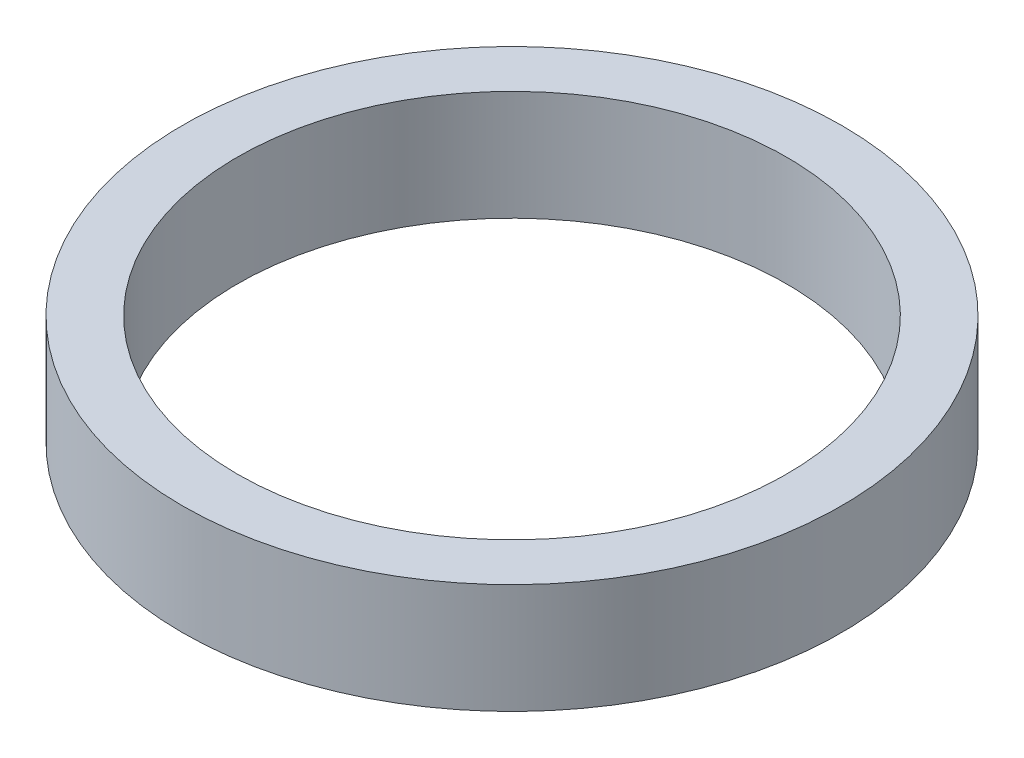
ISO-10303-21;
HEADER;
FILE_DESCRIPTION(('STEP AP214'),'2;1');
FILE_NAME('part.step','',(''),(''),'','','');
FILE_SCHEMA(('AUTOMOTIVE_DESIGN { 1 0 10303 214 1 1 1 1 }'));
ENDSEC;
DATA;
#1=APPLICATION_CONTEXT('core data for automotive mechanical design processes');
#2=APPLICATION_PROTOCOL_DEFINITION('international standard','automotive_design',2000,#1);
#3=PRODUCT_CONTEXT('',#1,'mechanical');
#4=PRODUCT('Part','Part','',(#3));
#5=PRODUCT_RELATED_PRODUCT_CATEGORY('part','',(#4));
#6=PRODUCT_DEFINITION_FORMATION('','',#4);
#7=PRODUCT_DEFINITION_CONTEXT('part definition',#1,'design');
#8=PRODUCT_DEFINITION('design','',#6,#7);
#9=PRODUCT_DEFINITION_SHAPE('','',#8);
#10=(LENGTH_UNIT() NAMED_UNIT(*) SI_UNIT(.MILLI.,.METRE.));
#11=(NAMED_UNIT(*) PLANE_ANGLE_UNIT() SI_UNIT($,.RADIAN.));
#12=(NAMED_UNIT(*) SI_UNIT($,.STERADIAN.) SOLID_ANGLE_UNIT());
#13=UNCERTAINTY_MEASURE_WITH_UNIT(LENGTH_MEASURE(1.E-05),#10,'distance_accuracy_value','');
#14=(GEOMETRIC_REPRESENTATION_CONTEXT(3) GLOBAL_UNCERTAINTY_ASSIGNED_CONTEXT((#13)) GLOBAL_UNIT_ASSIGNED_CONTEXT((#10,
#11,#12)) REPRESENTATION_CONTEXT('',''));
#15=CARTESIAN_POINT('',(0.,0.,0.));
#16=DIRECTION('',(0.,0.,1.));
#17=DIRECTION('',(1.,0.,0.));
#18=AXIS2_PLACEMENT_3D('',#15,#16,#17);
#19=CARTESIAN_POINT('',(0.,2.,0.));
#20=DIRECTION('',(0.,1.,0.));
#21=DIRECTION('',(0.,0.,1.));
#22=AXIS2_PLACEMENT_3D('',#19,#20,#21);
#23=PLANE('',#22);
#24=CARTESIAN_POINT('',(0.,2.,0.));
#25=DIRECTION('',(0.,1.,0.));
#26=DIRECTION('',(0.,0.,1.));
#27=AXIS2_PLACEMENT_3D('',#24,#25,#26);
#28=CIRCLE('',#27,6.);
#29=CARTESIAN_POINT('',(0.,2.,6.));
#30=VERTEX_POINT('',#29);
#31=EDGE_CURVE('E10',#30,#30,#28,.T.);
#32=ORIENTED_EDGE('',*,*,#31,.T.);
#33=EDGE_LOOP('',(#32));
#34=FACE_BOUND('',#33,.T.);
#35=CARTESIAN_POINT('',(0.,2.,0.));
#36=DIRECTION('',(0.,1.,0.));
#37=DIRECTION('',(0.,0.,1.));
#38=AXIS2_PLACEMENT_3D('',#35,#36,#37);
#39=CIRCLE('',#38,5.);
#40=CARTESIAN_POINT('',(0.,2.,5.));
#41=VERTEX_POINT('',#40);
#42=EDGE_CURVE('E56',#41,#41,#39,.T.);
#43=ORIENTED_EDGE('',*,*,#42,.F.);
#44=EDGE_LOOP('',(#43));
#45=FACE_BOUND('',#44,.T.);
#46=ADVANCED_FACE('F43',(#34,#45),#23,.T.);
#47=CARTESIAN_POINT('',(0.,0.,0.));
#48=DIRECTION('',(0.,1.,0.));
#49=DIRECTION('',(0.,0.,1.));
#50=AXIS2_PLACEMENT_3D('',#47,#48,#49);
#51=PLANE('',#50);
#52=CARTESIAN_POINT('',(0.,0.,0.));
#53=DIRECTION('',(0.,1.,0.));
#54=DIRECTION('',(0.,0.,1.));
#55=AXIS2_PLACEMENT_3D('',#52,#53,#54);
#56=CIRCLE('',#55,6.);
#57=CARTESIAN_POINT('',(0.,0.,6.));
#58=VERTEX_POINT('',#57);
#59=EDGE_CURVE('E47',#58,#58,#56,.T.);
#60=ORIENTED_EDGE('',*,*,#59,.F.);
#61=EDGE_LOOP('',(#60));
#62=FACE_BOUND('',#61,.T.);
#63=CARTESIAN_POINT('',(0.,0.,0.));
#64=DIRECTION('',(0.,1.,0.));
#65=DIRECTION('',(0.,0.,1.));
#66=AXIS2_PLACEMENT_3D('',#63,#64,#65);
#67=CIRCLE('',#66,5.);
#68=CARTESIAN_POINT('',(0.,0.,5.));
#69=VERTEX_POINT('',#68);
#70=EDGE_CURVE('E58',#69,#69,#67,.T.);
#71=ORIENTED_EDGE('',*,*,#70,.T.);
#72=EDGE_LOOP('',(#71));
#73=FACE_BOUND('',#72,.T.);
#74=ADVANCED_FACE('F70',(#62,#73),#51,.F.);
#75=CARTESIAN_POINT('',(0.,2.,0.));
#76=DIRECTION('',(0.,-1.,0.));
#77=DIRECTION('',(0.,0.,-1.));
#78=AXIS2_PLACEMENT_3D('',#75,#76,#77);
#79=CYLINDRICAL_SURFACE('',#78,6.);
#80=ORIENTED_EDGE('',*,*,#31,.F.);
#81=EDGE_LOOP('',(#80));
#82=FACE_BOUND('',#81,.T.);
#83=ORIENTED_EDGE('',*,*,#59,.T.);
#84=EDGE_LOOP('',(#83));
#85=FACE_BOUND('',#84,.T.);
#86=ADVANCED_FACE('F45',(#82,#85),#79,.T.);
#87=CARTESIAN_POINT('',(0.,2.,0.));
#88=DIRECTION('',(0.,-1.,0.));
#89=DIRECTION('',(0.,0.,-1.));
#90=AXIS2_PLACEMENT_3D('',#87,#88,#89);
#91=CYLINDRICAL_SURFACE('',#90,5.);
#92=ORIENTED_EDGE('',*,*,#42,.T.);
#93=EDGE_LOOP('',(#92));
#94=FACE_BOUND('',#93,.T.);
#95=ORIENTED_EDGE('',*,*,#70,.F.);
#96=EDGE_LOOP('',(#95));
#97=FACE_BOUND('',#96,.T.);
#98=ADVANCED_FACE('F66',(#94,#97),#91,.F.);
#99=CLOSED_SHELL('',(#46,#74,#86,#98));
#100=MANIFOLD_SOLID_BREP('B2',#99);
#101=ADVANCED_BREP_SHAPE_REPRESENTATION('',(#18,#100),#14);
#102=SHAPE_DEFINITION_REPRESENTATION(#9,#101);
ENDSEC;
END-ISO-10303-21;
